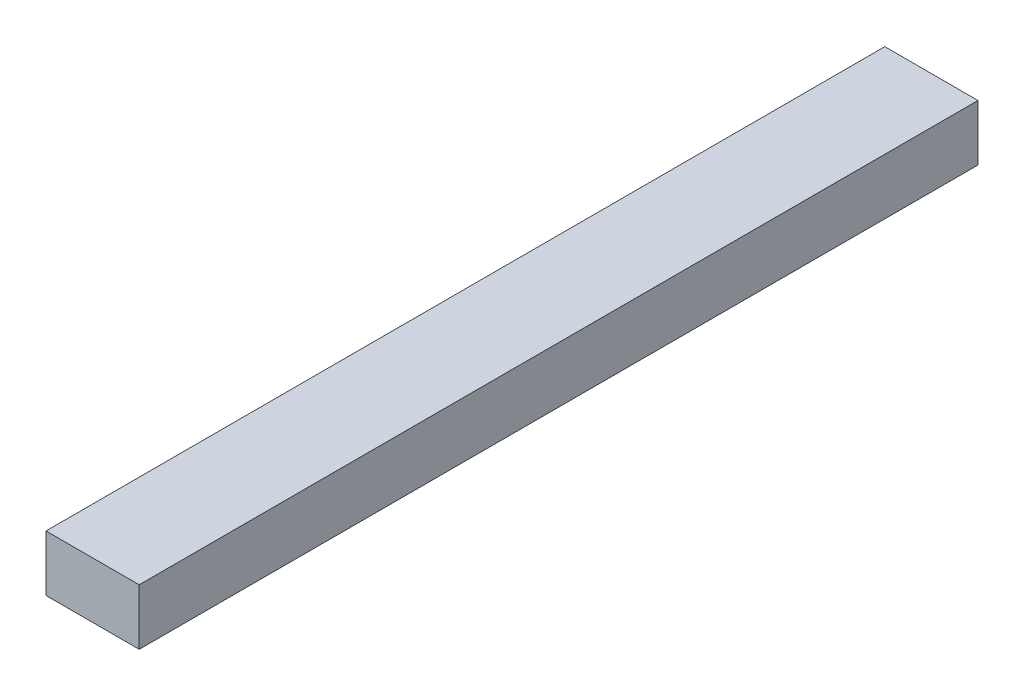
ISO-10303-21;
HEADER;
FILE_DESCRIPTION(('STEP AP214'),'2;1');
FILE_NAME('part.step','',(''),(''),'','','');
FILE_SCHEMA(('AUTOMOTIVE_DESIGN { 1 0 10303 214 1 1 1 1 }'));
ENDSEC;
DATA;
#1=APPLICATION_CONTEXT('core data for automotive mechanical design processes');
#2=APPLICATION_PROTOCOL_DEFINITION('international standard','automotive_design',2000,#1);
#3=PRODUCT_CONTEXT('',#1,'mechanical');
#4=PRODUCT('Part','Part','',(#3));
#5=PRODUCT_RELATED_PRODUCT_CATEGORY('part','',(#4));
#6=PRODUCT_DEFINITION_FORMATION('','',#4);
#7=PRODUCT_DEFINITION_CONTEXT('part definition',#1,'design');
#8=PRODUCT_DEFINITION('design','',#6,#7);
#9=PRODUCT_DEFINITION_SHAPE('','',#8);
#10=(LENGTH_UNIT() NAMED_UNIT(*) SI_UNIT(.MILLI.,.METRE.));
#11=(NAMED_UNIT(*) PLANE_ANGLE_UNIT() SI_UNIT($,.RADIAN.));
#12=(NAMED_UNIT(*) SI_UNIT($,.STERADIAN.) SOLID_ANGLE_UNIT());
#13=UNCERTAINTY_MEASURE_WITH_UNIT(LENGTH_MEASURE(1.E-05),#10,'distance_accuracy_value','');
#14=(GEOMETRIC_REPRESENTATION_CONTEXT(3) GLOBAL_UNCERTAINTY_ASSIGNED_CONTEXT((#13)) GLOBAL_UNIT_ASSIGNED_CONTEXT((#10,
#11,#12)) REPRESENTATION_CONTEXT('',''));
#15=CARTESIAN_POINT('',(0.,0.,0.));
#16=DIRECTION('',(0.,0.,1.));
#17=DIRECTION('',(1.,0.,0.));
#18=AXIS2_PLACEMENT_3D('',#15,#16,#17);
#19=CARTESIAN_POINT('',(2.5,-1.5,45.));
#20=DIRECTION('',(-1.,0.,0.));
#21=DIRECTION('',(0.,0.,1.));
#22=AXIS2_PLACEMENT_3D('',#19,#20,#21);
#23=PLANE('',#22);
#24=DIRECTION('',(0.,1.,0.));
#25=VECTOR('',#24,1.);
#26=CARTESIAN_POINT('',(2.5,-1.5,0.));
#27=LINE('',#26,#25);
#28=CARTESIAN_POINT('',(2.5,-1.5,0.));
#29=VERTEX_POINT('',#28);
#30=CARTESIAN_POINT('',(2.5,1.5,0.));
#31=VERTEX_POINT('',#30);
#32=EDGE_CURVE('E96',#29,#31,#27,.T.);
#33=ORIENTED_EDGE('',*,*,#32,.T.);
#34=DIRECTION('',(0.,0.,-1.));
#35=VECTOR('',#34,1.);
#36=CARTESIAN_POINT('',(2.5,1.5,45.));
#37=LINE('',#36,#35);
#38=CARTESIAN_POINT('',(2.5,1.5,45.));
#39=VERTEX_POINT('',#38);
#40=EDGE_CURVE('E11',#39,#31,#37,.T.);
#41=ORIENTED_EDGE('',*,*,#40,.F.);
#42=DIRECTION('',(0.,1.,0.));
#43=VECTOR('',#42,1.);
#44=CARTESIAN_POINT('',(2.5,-1.5,45.));
#45=LINE('',#44,#43);
#46=CARTESIAN_POINT('',(2.5,-1.5,45.));
#47=VERTEX_POINT('',#46);
#48=EDGE_CURVE('E84',#47,#39,#45,.T.);
#49=ORIENTED_EDGE('',*,*,#48,.F.);
#50=DIRECTION('',(0.,0.,-1.));
#51=VECTOR('',#50,1.);
#52=CARTESIAN_POINT('',(2.5,-1.5,45.));
#53=LINE('',#52,#51);
#54=EDGE_CURVE('E92',#47,#29,#53,.T.);
#55=ORIENTED_EDGE('',*,*,#54,.T.);
#56=EDGE_LOOP('',(#33,#41,#49,#55));
#57=FACE_BOUND('',#56,.T.);
#58=ADVANCED_FACE('F33',(#57),#23,.F.);
#59=CARTESIAN_POINT('',(-2.5,1.5,45.));
#60=DIRECTION('',(0.,-1.,0.));
#61=DIRECTION('',(0.,0.,-1.));
#62=AXIS2_PLACEMENT_3D('',#59,#60,#61);
#63=PLANE('',#62);
#64=DIRECTION('',(-1.,0.,0.));
#65=VECTOR('',#64,1.);
#66=CARTESIAN_POINT('',(-2.5,1.5,0.));
#67=LINE('',#66,#65);
#68=CARTESIAN_POINT('',(-2.5,1.5,0.));
#69=VERTEX_POINT('',#68);
#70=EDGE_CURVE('E88',#31,#69,#67,.T.);
#71=ORIENTED_EDGE('',*,*,#70,.T.);
#72=DIRECTION('',(0.,0.,-1.));
#73=VECTOR('',#72,1.);
#74=CARTESIAN_POINT('',(-2.5,1.5,45.));
#75=LINE('',#74,#73);
#76=CARTESIAN_POINT('',(-2.5,1.5,45.));
#77=VERTEX_POINT('',#76);
#78=EDGE_CURVE('E41',#77,#69,#75,.T.);
#79=ORIENTED_EDGE('',*,*,#78,.F.);
#80=DIRECTION('',(-1.,0.,0.));
#81=VECTOR('',#80,1.);
#82=CARTESIAN_POINT('',(-2.5,1.5,45.));
#83=LINE('',#82,#81);
#84=EDGE_CURVE('E79',#39,#77,#83,.T.);
#85=ORIENTED_EDGE('',*,*,#84,.F.);
#86=ORIENTED_EDGE('',*,*,#40,.T.);
#87=EDGE_LOOP('',(#71,#79,#85,#86));
#88=FACE_BOUND('',#87,.T.);
#89=ADVANCED_FACE('F87',(#88),#63,.F.);
#90=CARTESIAN_POINT('',(-2.5,-1.5,45.));
#91=DIRECTION('',(1.,0.,0.));
#92=DIRECTION('',(0.,0.,-1.));
#93=AXIS2_PLACEMENT_3D('',#90,#91,#92);
#94=PLANE('',#93);
#95=DIRECTION('',(0.,-1.,0.));
#96=VECTOR('',#95,1.);
#97=CARTESIAN_POINT('',(-2.5,-1.5,0.));
#98=LINE('',#97,#96);
#99=CARTESIAN_POINT('',(-2.5,-1.5,0.));
#100=VERTEX_POINT('',#99);
#101=EDGE_CURVE('E66',#69,#100,#98,.T.);
#102=ORIENTED_EDGE('',*,*,#101,.T.);
#103=DIRECTION('',(0.,0.,-1.));
#104=VECTOR('',#103,1.);
#105=CARTESIAN_POINT('',(-2.5,-1.5,45.));
#106=LINE('',#105,#104);
#107=CARTESIAN_POINT('',(-2.5,-1.5,45.));
#108=VERTEX_POINT('',#107);
#109=EDGE_CURVE('E89',#108,#100,#106,.T.);
#110=ORIENTED_EDGE('',*,*,#109,.F.);
#111=DIRECTION('',(0.,-1.,0.));
#112=VECTOR('',#111,1.);
#113=CARTESIAN_POINT('',(-2.5,-1.5,45.));
#114=LINE('',#113,#112);
#115=EDGE_CURVE('E82',#77,#108,#114,.T.);
#116=ORIENTED_EDGE('',*,*,#115,.F.);
#117=ORIENTED_EDGE('',*,*,#78,.T.);
#118=EDGE_LOOP('',(#102,#110,#116,#117));
#119=FACE_BOUND('',#118,.T.);
#120=ADVANCED_FACE('F90',(#119),#94,.F.);
#121=CARTESIAN_POINT('',(-2.5,-1.5,45.));
#122=DIRECTION('',(0.,1.,0.));
#123=DIRECTION('',(0.,0.,1.));
#124=AXIS2_PLACEMENT_3D('',#121,#122,#123);
#125=PLANE('',#124);
#126=DIRECTION('',(1.,0.,0.));
#127=VECTOR('',#126,1.);
#128=CARTESIAN_POINT('',(-2.5,-1.5,0.));
#129=LINE('',#128,#127);
#130=EDGE_CURVE('E72',#100,#29,#129,.T.);
#131=ORIENTED_EDGE('',*,*,#130,.T.);
#132=ORIENTED_EDGE('',*,*,#54,.F.);
#133=DIRECTION('',(1.,0.,0.));
#134=VECTOR('',#133,1.);
#135=CARTESIAN_POINT('',(-2.5,-1.5,45.));
#136=LINE('',#135,#134);
#137=EDGE_CURVE('E49',#108,#47,#136,.T.);
#138=ORIENTED_EDGE('',*,*,#137,.F.);
#139=ORIENTED_EDGE('',*,*,#109,.T.);
#140=EDGE_LOOP('',(#131,#132,#138,#139));
#141=FACE_BOUND('',#140,.T.);
#142=ADVANCED_FACE('F103',(#141),#125,.F.);
#143=CARTESIAN_POINT('',(0.,0.,45.));
#144=DIRECTION('',(0.,0.,-1.));
#145=DIRECTION('',(-1.,0.,0.));
#146=AXIS2_PLACEMENT_3D('',#143,#144,#145);
#147=PLANE('',#146);
#148=ORIENTED_EDGE('',*,*,#48,.T.);
#149=ORIENTED_EDGE('',*,*,#84,.T.);
#150=ORIENTED_EDGE('',*,*,#115,.T.);
#151=ORIENTED_EDGE('',*,*,#137,.T.);
#152=EDGE_LOOP('',(#148,#149,#150,#151));
#153=FACE_BOUND('',#152,.T.);
#154=ADVANCED_FACE('F80',(#153),#147,.F.);
#155=CARTESIAN_POINT('',(0.,0.,0.));
#156=DIRECTION('',(0.,0.,-1.));
#157=DIRECTION('',(-1.,0.,0.));
#158=AXIS2_PLACEMENT_3D('',#155,#156,#157);
#159=PLANE('',#158);
#160=ORIENTED_EDGE('',*,*,#32,.F.);
#161=ORIENTED_EDGE('',*,*,#130,.F.);
#162=ORIENTED_EDGE('',*,*,#101,.F.);
#163=ORIENTED_EDGE('',*,*,#70,.F.);
#164=EDGE_LOOP('',(#160,#161,#162,#163));
#165=FACE_BOUND('',#164,.T.);
#166=ADVANCED_FACE('F106',(#165),#159,.T.);
#167=CLOSED_SHELL('',(#58,#89,#120,#142,#154,#166));
#168=MANIFOLD_SOLID_BREP('B2',#167);
#169=ADVANCED_BREP_SHAPE_REPRESENTATION('',(#18,#168),#14);
#170=SHAPE_DEFINITION_REPRESENTATION(#9,#169);
ENDSEC;
END-ISO-10303-21;
